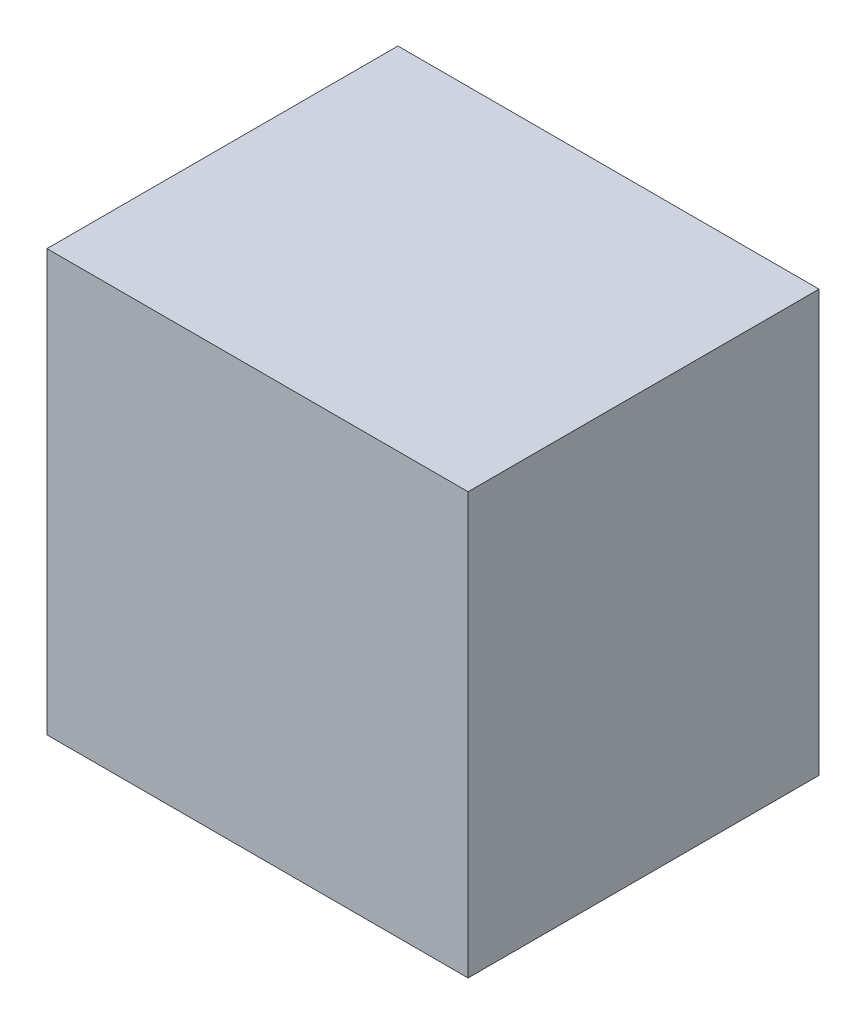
from build123d import *

# Parameters (mm, degrees)
SKETCH1_W           = 120
SKETCH1_H           = 120
BOSS_EXTRUDE1_DEPTH = 100


with BuildPart() as part:
    # Sketch1 → Boss-Extrude1 (new body)
    with BuildSketch(Plane.XY):
        with Locations((60, 60)):
            Rectangle(SKETCH1_W, SKETCH1_H)
    extrude(amount=BOSS_EXTRUDE1_DEPTH)


solid = part.part
